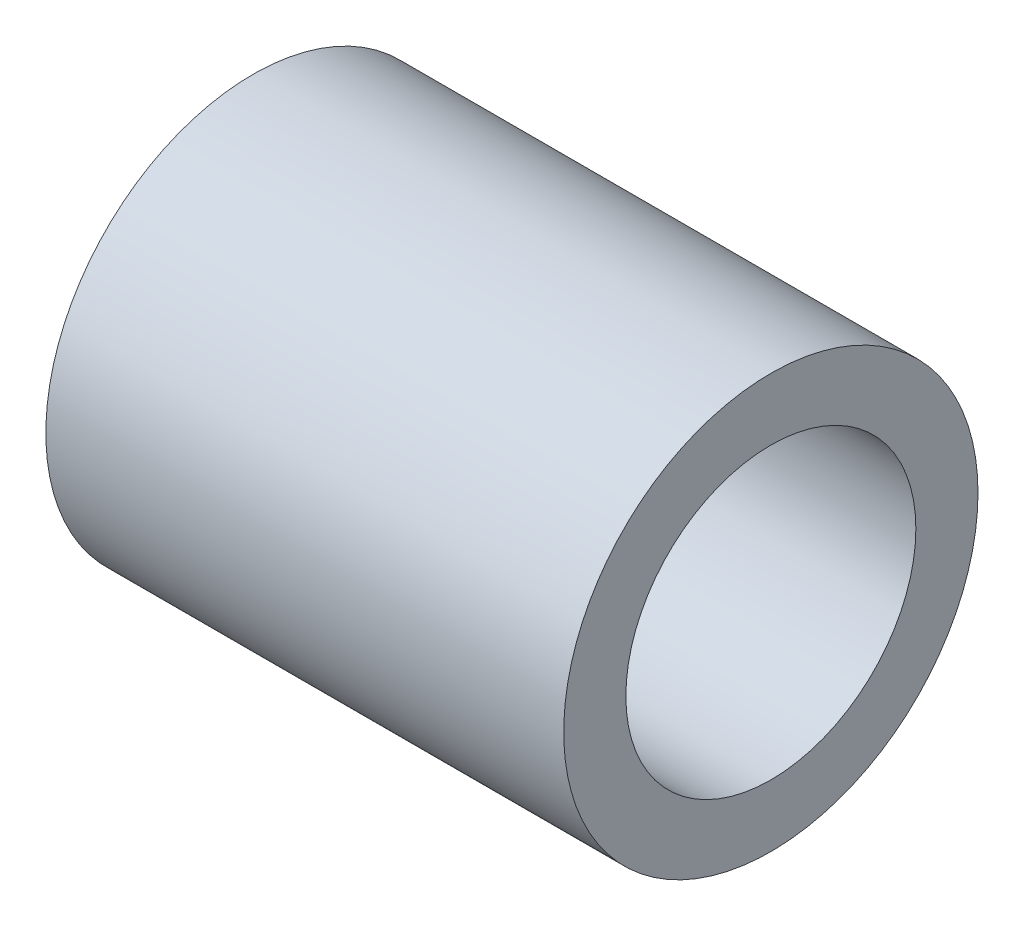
from build123d import *

# Parameters (mm, degrees)
FASE1_SIZE = 0.5


with BuildPart() as part:
    # Skizze1 → Rotation1 (revolve)
    with BuildSketch(Plane(origin=(0, 0, 0), x_dir=(1, 0, 0), z_dir=(0, 1, 0))):
        Polygon((0, 10), (-25, 10), (-25, 4.25), (-15, 4.25), (-15, 7), (0, 7), align=None)
    revolve(axis=Axis((0, 0, 0), (-1, 0, 0)))

    # Fase1
    fase1_edges = [part.edges().sort_by_distance(p)[0] for p in [
        (-15, 0, 4.25),
    ]]
    chamfer(fase1_edges, length=FASE1_SIZE)


solid = part.part
